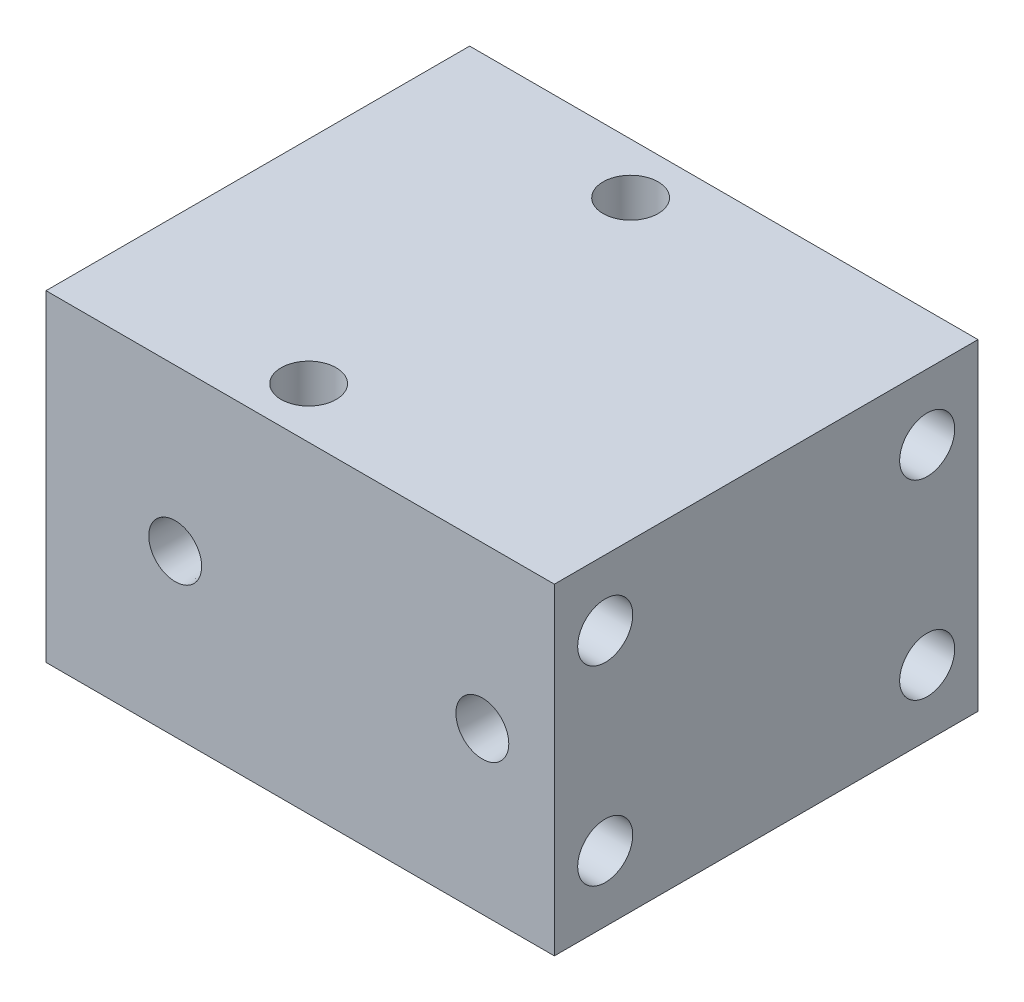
from build123d import *

# Parameters (mm, degrees)
SKETCH1_W                         = 120
SKETCH1_H                         = 100
SKETCH1_R                         = 6.5
EXTRUDE_H1_DEPTH                  = 76
SKETCH2_R                         = 0.5
CENTER_HOLE_DEPTH                 = 60
F_1_4_NPT_TAPPED_HOLE1_AT_2_COUNT = 2
F_1_4_NPT_TAPPED_HOLE1_AT_2_PITCH = 72.5
MTG_HOLE_REACH                    = 152.586
SKETCH6_R                         = 6.5
SKETCH5_R                         = 2
OIL_HOLE_DEPTH                    = 20


with BuildPart() as part:
    # Sketch1 → Extrude H1 (new body)
    with BuildSketch(Plane(origin=(0, 0, 0), x_dir=(1, 0, 0), z_dir=(0, 1, 0))):
        Rectangle(SKETCH1_W, SKETCH1_H)
        with Locations(Location((-10, 38, 0), (0, 0, 270))):
            Circle(SKETCH1_R, mode=Mode.SUBTRACT)
        with Locations(Location((-10, -38, 0), (0, 0, 270))):
            Circle(SKETCH1_R, mode=Mode.SUBTRACT)
    extrude(amount=EXTRUDE_H1_DEPTH)

    # Sketch2 → CENTER HOLE (cut)
    with BuildSketch(Plane.ZY.offset(60)):
        with Locations((0, 38)):
            Circle(SKETCH2_R)
    extrude(amount=-CENTER_HOLE_DEPTH, mode=Mode.SUBTRACT)

    # Sketch3 → 1_4 NPT Tapped Hole1 (revolve, cut)
    with BuildSketch(Plane(origin=(43, 38, 50), x_dir=(0, -1, 0), z_dir=(1, 0, 0))):
        Polygon((0, 0), (0, 20.412347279), (5.5626, 17.07), (5.5626, 10.02), (5.943676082, 10.02), (6.2436883, 0), align=None)
    f_1_4_npt_tapped_hole1 = revolve(axis=Axis((43, 38, 56.35), (0, 0, -1)), mode=Mode.SUBTRACT)

    # 1_4 NPT Tapped Hole1 at 2: 1_4 NPT Tapped Hole1 ×2
    with Locations(*[(-i * F_1_4_NPT_TAPPED_HOLE1_AT_2_PITCH, 0, 0) for i in range(1, F_1_4_NPT_TAPPED_HOLE1_AT_2_COUNT)]):
        add(f_1_4_npt_tapped_hole1, mode=Mode.SUBTRACT)

    # MTG HOLE: up to this face of the body (flat: up to its plane)
    mtg_hole_end = Plane(part.part.faces().sort_by_distance((60, 38, 0))[0])
    # Sketch6 → MTG HOLE (cut, up to the picked face)
    with BuildSketch(Plane.ZY.offset(60), mode=Mode.PRIVATE) as mtg_hole_sk1:
        with Locations((-38, 60.5)):
            Circle(SKETCH6_R)
    mtg_hole_tool1 = split(extrude(mtg_hole_sk1.sketch, amount=-MTG_HOLE_REACH, mode=Mode.PRIVATE), bisect_by=mtg_hole_end, keep=Keep.BOTH, mode=Mode.PRIVATE)
    # Sketch6 → MTG HOLE (cut, up to the picked face)
    with BuildSketch(Plane.ZY.offset(60), mode=Mode.PRIVATE) as mtg_hole_sk2:
        with Locations((-38, 15.5)):
            Circle(SKETCH6_R)
    mtg_hole_tool2 = split(extrude(mtg_hole_sk2.sketch, amount=-MTG_HOLE_REACH, mode=Mode.PRIVATE), bisect_by=mtg_hole_end, keep=Keep.BOTH, mode=Mode.PRIVATE)
    # Sketch6 → MTG HOLE (cut, up to the picked face)
    with BuildSketch(Plane.ZY.offset(60), mode=Mode.PRIVATE) as mtg_hole_sk3:
        with Locations((38, 60.5)):
            Circle(SKETCH6_R)
    mtg_hole_tool3 = split(extrude(mtg_hole_sk3.sketch, amount=-MTG_HOLE_REACH, mode=Mode.PRIVATE), bisect_by=mtg_hole_end, keep=Keep.BOTH, mode=Mode.PRIVATE)
    # Sketch6 → MTG HOLE (cut, up to the picked face)
    with BuildSketch(Plane.ZY.offset(60), mode=Mode.PRIVATE) as mtg_hole_sk4:
        with Locations((38, 15.5)):
            Circle(SKETCH6_R)
    mtg_hole_tool4 = split(extrude(mtg_hole_sk4.sketch, amount=-MTG_HOLE_REACH, mode=Mode.PRIVATE), bisect_by=mtg_hole_end, keep=Keep.BOTH, mode=Mode.PRIVATE)
    add(mtg_hole_tool1.solids().sort_by(Axis((-60, 60.5, -38), (1, 0, 0)))[0], mode=Mode.SUBTRACT)
    add(mtg_hole_tool2.solids().sort_by(Axis((-60, 15.5, -38), (1, 0, 0)))[0], mode=Mode.SUBTRACT)
    add(mtg_hole_tool3.solids().sort_by(Axis((-60, 60.5, 38), (1, 0, 0)))[0], mode=Mode.SUBTRACT)
    add(mtg_hole_tool4.solids().sort_by(Axis((-60, 15.5, 38), (1, 0, 0)))[0], mode=Mode.SUBTRACT)

    # Sketch5 → OIL HOLE (cut)
    with BuildSketch(Plane.XY.offset(50)):
        with Locations((-29.5, 38)):
            Circle(SKETCH5_R)
        with Locations((43, 38)):
            Circle(SKETCH5_R)
    extrude(amount=-OIL_HOLE_DEPTH, mode=Mode.SUBTRACT)


solid = part.part
